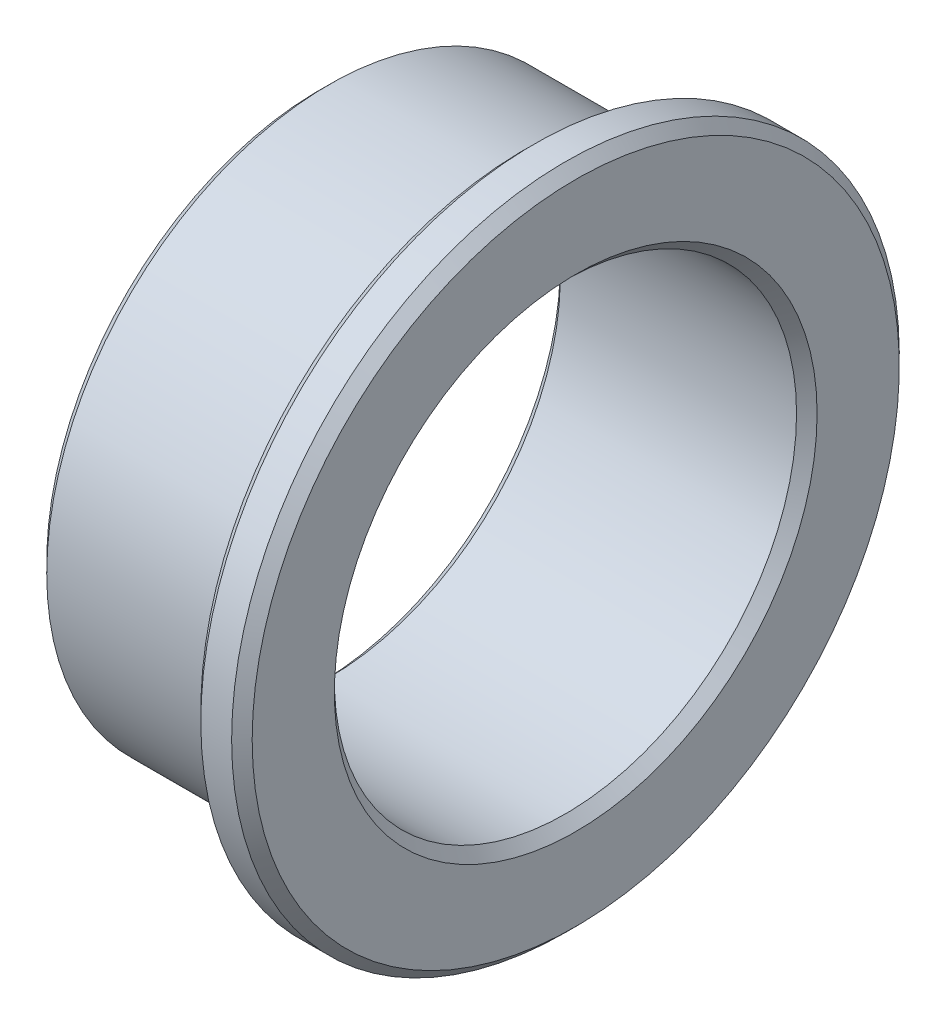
ISO-10303-21;
HEADER;
FILE_DESCRIPTION(('STEP AP214'),'2;1');
FILE_NAME('part.step','',(''),(''),'','','');
FILE_SCHEMA(('AUTOMOTIVE_DESIGN { 1 0 10303 214 1 1 1 1 }'));
ENDSEC;
DATA;
#1=APPLICATION_CONTEXT('core data for automotive mechanical design processes');
#2=APPLICATION_PROTOCOL_DEFINITION('international standard','automotive_design',2000,#1);
#3=PRODUCT_CONTEXT('',#1,'mechanical');
#4=PRODUCT('Part','Part','',(#3));
#5=PRODUCT_RELATED_PRODUCT_CATEGORY('part','',(#4));
#6=PRODUCT_DEFINITION_FORMATION('','',#4);
#7=PRODUCT_DEFINITION_CONTEXT('part definition',#1,'design');
#8=PRODUCT_DEFINITION('design','',#6,#7);
#9=PRODUCT_DEFINITION_SHAPE('','',#8);
#10=(LENGTH_UNIT() NAMED_UNIT(*) SI_UNIT(.MILLI.,.METRE.));
#11=(NAMED_UNIT(*) PLANE_ANGLE_UNIT() SI_UNIT($,.RADIAN.));
#12=(NAMED_UNIT(*) SI_UNIT($,.STERADIAN.) SOLID_ANGLE_UNIT());
#13=UNCERTAINTY_MEASURE_WITH_UNIT(LENGTH_MEASURE(1.E-05),#10,'distance_accuracy_value','');
#14=(GEOMETRIC_REPRESENTATION_CONTEXT(3) GLOBAL_UNCERTAINTY_ASSIGNED_CONTEXT((#13)) GLOBAL_UNIT_ASSIGNED_CONTEXT((#10,
#11,#12)) REPRESENTATION_CONTEXT('',''));
#15=CARTESIAN_POINT('',(0.,0.,0.));
#16=DIRECTION('',(0.,0.,1.));
#17=DIRECTION('',(1.,0.,0.));
#18=AXIS2_PLACEMENT_3D('',#15,#16,#17);
#19=CARTESIAN_POINT('',(0.4,0.,0.));
#20=DIRECTION('',(1.,0.,0.));
#21=DIRECTION('',(0.,0.,-1.));
#22=AXIS2_PLACEMENT_3D('',#19,#20,#21);
#23=CONICAL_SURFACE('',#22,11.,0.78539816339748);
#24=CARTESIAN_POINT('',(0.4,0.,0.));
#25=DIRECTION('',(-1.,0.,0.));
#26=DIRECTION('',(0.,0.809016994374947,0.587785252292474));
#27=AXIS2_PLACEMENT_3D('',#24,#25,#26);
#28=CIRCLE('',#27,11.);
#29=CARTESIAN_POINT('',(0.4,8.89918693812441,6.4656377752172));
#30=VERTEX_POINT('',#29);
#31=EDGE_CURVE('E54',#30,#30,#28,.T.);
#32=ORIENTED_EDGE('',*,*,#31,.T.);
#33=EDGE_LOOP('',(#32));
#34=FACE_BOUND('',#33,.T.);
#35=CARTESIAN_POINT('',(0.,0.,0.));
#36=DIRECTION('',(1.,0.,0.));
#37=DIRECTION('',(0.,0.,-1.));
#38=AXIS2_PLACEMENT_3D('',#35,#36,#37);
#39=CIRCLE('',#38,10.6);
#40=CARTESIAN_POINT('',(0.,0.,-10.6));
#41=VERTEX_POINT('',#40);
#42=EDGE_CURVE('E56',#41,#41,#39,.F.);
#43=ORIENTED_EDGE('',*,*,#42,.F.);
#44=EDGE_LOOP('',(#43));
#45=FACE_BOUND('',#44,.T.);
#46=ADVANCED_FACE('F14',(#34,#45),#23,.T.);
#47=CARTESIAN_POINT('',(0.,-14.806103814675,2.3450564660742));
#48=DIRECTION('',(-1.,0.,0.));
#49=DIRECTION('',(0.,0.809016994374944,0.587785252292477));
#50=AXIS2_PLACEMENT_3D('',#47,#48,#49);
#51=PLANE('',#50);
#52=CARTESIAN_POINT('',(0.,0.,0.));
#53=DIRECTION('',(-1.,0.,0.));
#54=DIRECTION('',(0.,0.,1.));
#55=AXIS2_PLACEMENT_3D('',#52,#53,#54);
#56=CIRCLE('',#55,9.39999999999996);
#57=CARTESIAN_POINT('',(0.,0.,9.39999999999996));
#58=VERTEX_POINT('',#57);
#59=EDGE_CURVE('E49',#58,#58,#56,.T.);
#60=ORIENTED_EDGE('',*,*,#59,.F.);
#61=EDGE_LOOP('',(#60));
#62=FACE_BOUND('',#61,.T.);
#63=ORIENTED_EDGE('',*,*,#42,.T.);
#64=EDGE_LOOP('',(#63));
#65=FACE_BOUND('',#64,.T.);
#66=ADVANCED_FACE('F104',(#62,#65),#51,.T.);
#67=CARTESIAN_POINT('',(8.,0.,0.));
#68=DIRECTION('',(-1.,0.,0.));
#69=DIRECTION('',(0.,0.,1.));
#70=AXIS2_PLACEMENT_3D('',#67,#68,#69);
#71=CYLINDRICAL_SURFACE('',#70,11.);
#72=CARTESIAN_POINT('',(8.,0.,0.));
#73=DIRECTION('',(-1.,0.,0.));
#74=DIRECTION('',(0.,0.,1.));
#75=AXIS2_PLACEMENT_3D('',#72,#73,#74);
#76=CIRCLE('',#75,11.);
#77=CARTESIAN_POINT('',(8.,0.,11.));
#78=VERTEX_POINT('',#77);
#79=EDGE_CURVE('E46',#78,#78,#76,.F.);
#80=ORIENTED_EDGE('',*,*,#79,.F.);
#81=EDGE_LOOP('',(#80));
#82=FACE_BOUND('',#81,.T.);
#83=ORIENTED_EDGE('',*,*,#31,.F.);
#84=EDGE_LOOP('',(#83));
#85=FACE_BOUND('',#84,.T.);
#86=ADVANCED_FACE('F106',(#82,#85),#71,.T.);
#87=CARTESIAN_POINT('',(0.4,0.,0.));
#88=DIRECTION('',(-1.,0.,0.));
#89=DIRECTION('',(0.,0.,1.));
#90=AXIS2_PLACEMENT_3D('',#87,#88,#89);
#91=CONICAL_SURFACE('',#90,9.00000000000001,0.7853981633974);
#92=ORIENTED_EDGE('',*,*,#59,.T.);
#93=EDGE_LOOP('',(#92));
#94=FACE_BOUND('',#93,.T.);
#95=CARTESIAN_POINT('',(0.399999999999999,0.,0.));
#96=DIRECTION('',(-1.,0.,0.));
#97=DIRECTION('',(0.,0.809016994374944,0.587785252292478));
#98=AXIS2_PLACEMENT_3D('',#95,#96,#97);
#99=CIRCLE('',#98,9.00000000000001);
#100=CARTESIAN_POINT('',(0.4,7.2811529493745,5.2900672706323));
#101=VERTEX_POINT('',#100);
#102=EDGE_CURVE('E43',#101,#101,#99,.T.);
#103=ORIENTED_EDGE('',*,*,#102,.F.);
#104=EDGE_LOOP('',(#103));
#105=FACE_BOUND('',#104,.T.);
#106=ADVANCED_FACE('F111',(#94,#105),#91,.F.);
#107=CARTESIAN_POINT('',(8.,-17.59970830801,2.7875199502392));
#108=DIRECTION('',(-1.,0.,0.));
#109=DIRECTION('',(0.,0.809016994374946,0.587785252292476));
#110=AXIS2_PLACEMENT_3D('',#107,#108,#109);
#111=PLANE('',#110);
#112=ORIENTED_EDGE('',*,*,#79,.T.);
#113=EDGE_LOOP('',(#112));
#114=FACE_BOUND('',#113,.T.);
#115=CARTESIAN_POINT('',(8.,0.,0.));
#116=DIRECTION('',(1.,0.,0.));
#117=DIRECTION('',(0.,0.,-1.));
#118=AXIS2_PLACEMENT_3D('',#115,#116,#117);
#119=CIRCLE('',#118,12.5999999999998);
#120=CARTESIAN_POINT('',(8.,0.,-12.5999999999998));
#121=VERTEX_POINT('',#120);
#122=EDGE_CURVE('E39',#121,#121,#119,.F.);
#123=ORIENTED_EDGE('',*,*,#122,.T.);
#124=EDGE_LOOP('',(#123));
#125=FACE_BOUND('',#124,.T.);
#126=ADVANCED_FACE('F108',(#114,#125),#111,.T.);
#127=CARTESIAN_POINT('',(9.6,0.,0.));
#128=DIRECTION('',(-1.,0.,0.));
#129=DIRECTION('',(0.,0.,1.));
#130=AXIS2_PLACEMENT_3D('',#127,#128,#129);
#131=CYLINDRICAL_SURFACE('',#130,9.00000000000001);
#132=ORIENTED_EDGE('',*,*,#102,.T.);
#133=EDGE_LOOP('',(#132));
#134=FACE_BOUND('',#133,.T.);
#135=CARTESIAN_POINT('',(9.6,0.,0.));
#136=DIRECTION('',(-1.,0.,0.));
#137=DIRECTION('',(0.,0.809016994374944,0.587785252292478));
#138=AXIS2_PLACEMENT_3D('',#135,#136,#137);
#139=CIRCLE('',#138,9.00000000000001);
#140=CARTESIAN_POINT('',(9.6,7.2811529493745,5.2900672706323));
#141=VERTEX_POINT('',#140);
#142=EDGE_CURVE('E42',#141,#141,#139,.T.);
#143=ORIENTED_EDGE('',*,*,#142,.F.);
#144=EDGE_LOOP('',(#143));
#145=FACE_BOUND('',#144,.T.);
#146=ADVANCED_FACE('F110',(#134,#145),#131,.F.);
#147=CARTESIAN_POINT('',(8.4,0.,0.));
#148=DIRECTION('',(1.,0.,0.));
#149=DIRECTION('',(0.,0.,-1.));
#150=AXIS2_PLACEMENT_3D('',#147,#148,#149);
#151=CONICAL_SURFACE('',#150,12.9999999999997,0.785398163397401);
#152=CARTESIAN_POINT('',(8.4,0.,0.));
#153=DIRECTION('',(-1.,0.,0.));
#154=DIRECTION('',(0.,0.809016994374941,0.587785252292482));
#155=AXIS2_PLACEMENT_3D('',#152,#153,#154);
#156=CIRCLE('',#155,12.9999999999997);
#157=CARTESIAN_POINT('',(8.4,10.517220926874,7.6412082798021));
#158=VERTEX_POINT('',#157);
#159=EDGE_CURVE('E36',#158,#158,#156,.T.);
#160=ORIENTED_EDGE('',*,*,#159,.T.);
#161=EDGE_LOOP('',(#160));
#162=FACE_BOUND('',#161,.T.);
#163=ORIENTED_EDGE('',*,*,#122,.F.);
#164=EDGE_LOOP('',(#163));
#165=FACE_BOUND('',#164,.T.);
#166=ADVANCED_FACE('F80',(#162,#165),#151,.T.);
#167=CARTESIAN_POINT('',(10.,0.,0.));
#168=DIRECTION('',(1.,0.,0.));
#169=DIRECTION('',(0.,0.,-1.));
#170=AXIS2_PLACEMENT_3D('',#167,#168,#169);
#171=CONICAL_SURFACE('',#170,9.39999999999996,0.785398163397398);
#172=ORIENTED_EDGE('',*,*,#142,.T.);
#173=EDGE_LOOP('',(#172));
#174=FACE_BOUND('',#173,.T.);
#175=CARTESIAN_POINT('',(10.,0.,0.));
#176=DIRECTION('',(1.,0.,0.));
#177=DIRECTION('',(0.,0.,-1.));
#178=AXIS2_PLACEMENT_3D('',#175,#176,#177);
#179=CIRCLE('',#178,9.39999999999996);
#180=CARTESIAN_POINT('',(10.,0.,-9.39999999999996));
#181=VERTEX_POINT('',#180);
#182=EDGE_CURVE('E27',#181,#181,#179,.F.);
#183=ORIENTED_EDGE('',*,*,#182,.F.);
#184=EDGE_LOOP('',(#183));
#185=FACE_BOUND('',#184,.T.);
#186=ADVANCED_FACE('F85',(#174,#185),#171,.F.);
#187=CARTESIAN_POINT('',(9.6,0.,0.));
#188=DIRECTION('',(-1.,0.,0.));
#189=DIRECTION('',(0.,0.,1.));
#190=AXIS2_PLACEMENT_3D('',#187,#188,#189);
#191=CYLINDRICAL_SURFACE('',#190,12.9999999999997);
#192=CARTESIAN_POINT('',(9.6,0.,0.));
#193=DIRECTION('',(-1.,0.,0.));
#194=DIRECTION('',(0.,0.809016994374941,0.587785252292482));
#195=AXIS2_PLACEMENT_3D('',#192,#193,#194);
#196=CIRCLE('',#195,12.9999999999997);
#197=CARTESIAN_POINT('',(9.6,10.517220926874,7.6412082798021));
#198=VERTEX_POINT('',#197);
#199=EDGE_CURVE('E22',#198,#198,#196,.T.);
#200=ORIENTED_EDGE('',*,*,#199,.T.);
#201=EDGE_LOOP('',(#200));
#202=FACE_BOUND('',#201,.T.);
#203=ORIENTED_EDGE('',*,*,#159,.F.);
#204=EDGE_LOOP('',(#203));
#205=FACE_BOUND('',#204,.T.);
#206=ADVANCED_FACE('F83',(#202,#205),#191,.T.);
#207=CARTESIAN_POINT('',(10.,-2.7875199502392,-17.599708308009));
#208=DIRECTION('',(1.,0.,0.));
#209=DIRECTION('',(0.,0.809016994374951,0.587785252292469));
#210=AXIS2_PLACEMENT_3D('',#207,#208,#209);
#211=PLANE('',#210);
#212=ORIENTED_EDGE('',*,*,#182,.T.);
#213=EDGE_LOOP('',(#212));
#214=FACE_BOUND('',#213,.T.);
#215=CARTESIAN_POINT('',(10.,0.,0.));
#216=DIRECTION('',(-1.,0.,0.));
#217=DIRECTION('',(0.,0.,1.));
#218=AXIS2_PLACEMENT_3D('',#215,#216,#217);
#219=CIRCLE('',#218,12.5999999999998);
#220=CARTESIAN_POINT('',(10.,0.,12.5999999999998));
#221=VERTEX_POINT('',#220);
#222=EDGE_CURVE('E10',#221,#221,#219,.F.);
#223=ORIENTED_EDGE('',*,*,#222,.T.);
#224=EDGE_LOOP('',(#223));
#225=FACE_BOUND('',#224,.T.);
#226=ADVANCED_FACE('F16',(#214,#225),#211,.T.);
#227=CARTESIAN_POINT('',(10.,0.,0.));
#228=DIRECTION('',(-1.,0.,0.));
#229=DIRECTION('',(0.,0.,1.));
#230=AXIS2_PLACEMENT_3D('',#227,#228,#229);
#231=CONICAL_SURFACE('',#230,12.5999999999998,0.785398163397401);
#232=ORIENTED_EDGE('',*,*,#222,.F.);
#233=EDGE_LOOP('',(#232));
#234=FACE_BOUND('',#233,.T.);
#235=ORIENTED_EDGE('',*,*,#199,.F.);
#236=EDGE_LOOP('',(#235));
#237=FACE_BOUND('',#236,.T.);
#238=ADVANCED_FACE('F93',(#234,#237),#231,.T.);
#239=CLOSED_SHELL('',(#46,#66,#86,#106,#126,#146,#166,#186,#206,#226,#238));
#240=MANIFOLD_SOLID_BREP('B1',#239);
#241=ADVANCED_BREP_SHAPE_REPRESENTATION('',(#18,#240),#14);
#242=SHAPE_DEFINITION_REPRESENTATION(#9,#241);
ENDSEC;
END-ISO-10303-21;
